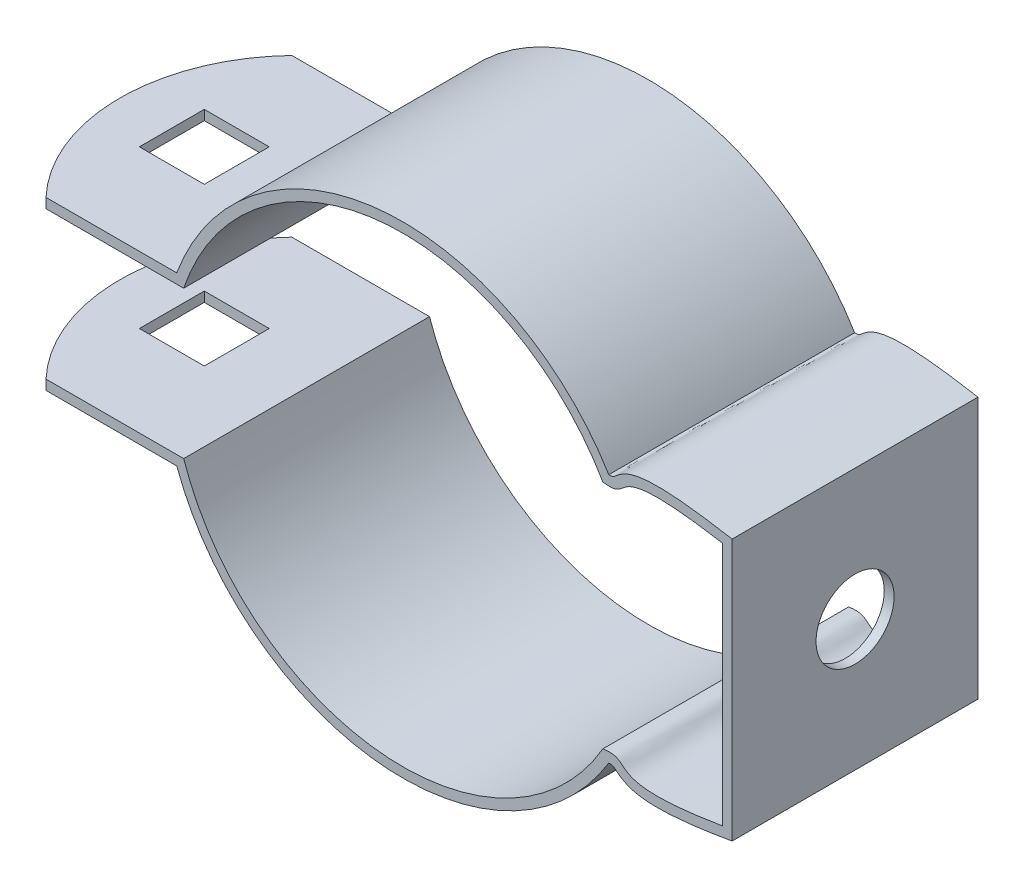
from build123d import *

# Parameters (mm, degrees)
BOSS_EXTRUDE1_DEPTH = 25
BOSS_EXTRUDE2_START = -17
BOSS_EXTRUDE2_DEPTH = 17
SKETCH3_W           = 25
SKETCH3_H           = 15
CUT_EXTRUDE1_DEPTH  = 25
SKETCH4_W           = 6.604
SKETCH4_H           = 6.604
CUT_EXTRUDE2_DEPTH  = 25
SKETCH6_R           = 3.96875
CUT_EXTRUDE3_DEPTH  = 25


with BuildPart() as part:
    # Sketch1 → Boss-Extrude1 (new body)
    with BuildSketch(Plane.XY):
        with BuildLine():
            Line((33.5, 13.298044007), (33.5, -13.298044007))
            add(Edge.make_bspline(
                [(20.955792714, -12.692704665), (21.00562294, -12.691065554), (21.115419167, -12.691423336), (21.254569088, -12.705136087), (21.349606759, -12.73080144), (21.416147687, -12.762621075), (21.578037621, -12.87122057), (21.993180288, -13.248397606), (22.92637317, -13.788741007), (24.30119451, -14.115662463), (25.968158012, -14.187672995), (27.7553724, -14.092276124), (29.357383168, -13.933241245), (30.934069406, -13.719412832), (32.366155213, -13.491606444), (33.125703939, -13.361361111), (33.5, -13.298044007)],
                knots=[0.053315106, 0.053315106, 0.053315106, 0.053315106, 0.079093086, 0.104871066, 0.156427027, 0.207982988, 0.259538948, 0.36265087, 0.465762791, 0.568874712, 0.671986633, 0.723542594, 0.775098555, 0.826654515, 0.852432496, 0.878210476, 0.878210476, 0.878210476, 0.878210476], degree=3))
            ThreePointArc((20.955792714, -12.692704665), (-2.327504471, -24.389192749), (-22.978250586, -8.5))
            Line((-22.978250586, -8.5), (-36.271057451, -8.5))
            Line((-36.271057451, -8.5), (-36.271057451, -7.5))
            Line((-36.271057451, -7.5), (-22.271057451, -7.5))
            ThreePointArc((-22.271057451, -7.5), (-2.331674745, -23.384039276), (20.351596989, -11.75))
            add(Edge.make_bspline(
                [(20.351596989, -11.75), (23.843322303, -11.2163624), (20.029109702, -14.562615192), (32.5, -12.453)],
                knots=[0, 0, 0, 0, 0.8590782, 0.8590782, 0.8590782, 0.8590782], degree=3))
            Line((32.5, -12.453), (32.5, 12.453))
            add(Edge.make_bspline(
                [(20.351596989, 11.75), (23.843322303, 11.2163624), (20.029109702, 14.562615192), (32.5, 12.453)],
                knots=[0, 0, 0, 0, 0.8590782, 0.8590782, 0.8590782, 0.8590782], degree=3))
            ThreePointArc((20.351596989, 11.75), (-2.331674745, 23.384039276), (-22.271057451, 7.5))
            Line((-22.271057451, 7.5), (-36.271057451, 7.5))
            Line((-36.271057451, 7.5), (-36.271057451, 8.5))
            Line((-36.271057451, 8.5), (-22.978250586, 8.5))
            ThreePointArc((-22.978250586, 8.5), (-2.327504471, 24.389192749), (20.955792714, 12.692704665))
            add(Edge.make_bspline(
                [(33.5, 13.298044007), (33.125703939, 13.361361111), (32.366155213, 13.491606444), (30.934069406, 13.719412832), (29.357383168, 13.933241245), (27.7553724, 14.092276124), (25.968158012, 14.187672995), (24.30119451, 14.115662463), (22.92637317, 13.788741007), (21.993180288, 13.248397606), (21.578037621, 12.87122057), (21.416147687, 12.762621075), (21.349606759, 12.73080144), (21.254569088, 12.705136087), (21.115419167, 12.691423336), (21.00562294, 12.691065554), (20.955792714, 12.692704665)],
                knots=[0.053315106, 0.053315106, 0.053315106, 0.053315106, 0.079093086, 0.104871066, 0.156427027, 0.207982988, 0.259538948, 0.36265087, 0.465762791, 0.568874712, 0.671986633, 0.723542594, 0.775098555, 0.826654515, 0.852432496, 0.878210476, 0.878210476, 0.878210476, 0.878210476], degree=3))
        make_face()
    extrude(amount=BOSS_EXTRUDE1_DEPTH)

    # Sketch2 → Boss-Extrude2 (add)
    with BuildSketch(Plane.XZ.offset(8.5).offset(BOSS_EXTRUDE2_START)):
        with BuildLine():
            Line((-36.271057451, 25), (-36.271057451, 0))
            ThreePointArc((-36.271057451, 0), (-41.271057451, 12.5), (-36.271057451, 25))
        make_face()
    boss_extrude2 = extrude(amount=BOSS_EXTRUDE2_DEPTH)

    # Mirror1: Boss-Extrude2 across plane
    add(boss_extrude2.mirror(Plane.ZX))

    # Sketch3 → Cut-Extrude1 (cut)
    with BuildSketch(Plane(origin=(-36.271057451, 0, 0), x_dir=(0, 0, -1), z_dir=(1, 0, 0))):
        with Locations((-12.5, 0)):
            Rectangle(SKETCH3_W, SKETCH3_H)
    extrude(amount=-CUT_EXTRUDE1_DEPTH, mode=Mode.SUBTRACT)

    # Sketch4 → Cut-Extrude2 (cut)
    with BuildSketch(Plane.XZ.offset(8.5)):
        with Locations((-32.676250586, 12.5)):
            Rectangle(SKETCH4_W, SKETCH4_H)
    extrude(amount=-CUT_EXTRUDE2_DEPTH, mode=Mode.SUBTRACT)

    # Sketch6 → Cut-Extrude3 (cut)
    with BuildSketch(Plane(origin=(33.5, 0, 0), x_dir=(0, 0, -1), z_dir=(1, 0, 0))):
        with Locations((-12.5, 0)):
            Circle(SKETCH6_R)
    extrude(amount=-CUT_EXTRUDE3_DEPTH, mode=Mode.SUBTRACT)


solid = part.part
